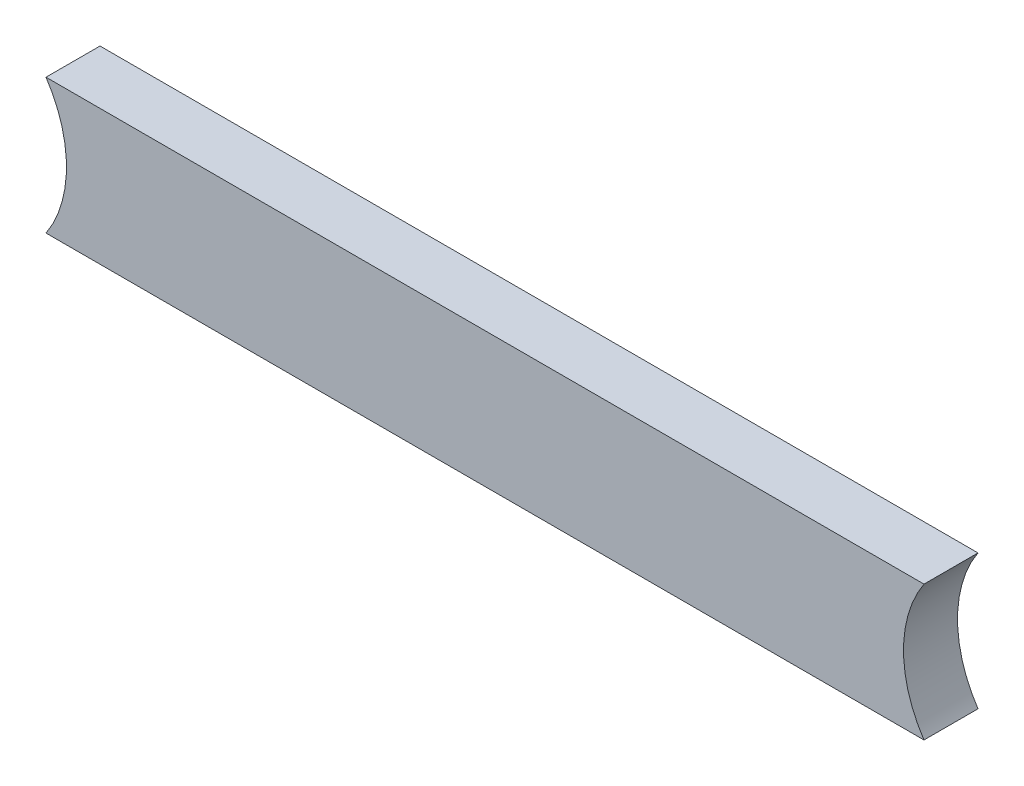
ISO-10303-21;
HEADER;
FILE_DESCRIPTION(('STEP AP214'),'2;1');
FILE_NAME('part.step','',(''),(''),'','','');
FILE_SCHEMA(('AUTOMOTIVE_DESIGN { 1 0 10303 214 1 1 1 1 }'));
ENDSEC;
DATA;
#1=APPLICATION_CONTEXT('core data for automotive mechanical design processes');
#2=APPLICATION_PROTOCOL_DEFINITION('international standard','automotive_design',2000,#1);
#3=PRODUCT_CONTEXT('',#1,'mechanical');
#4=PRODUCT('Part','Part','',(#3));
#5=PRODUCT_RELATED_PRODUCT_CATEGORY('part','',(#4));
#6=PRODUCT_DEFINITION_FORMATION('','',#4);
#7=PRODUCT_DEFINITION_CONTEXT('part definition',#1,'design');
#8=PRODUCT_DEFINITION('design','',#6,#7);
#9=PRODUCT_DEFINITION_SHAPE('','',#8);
#10=(LENGTH_UNIT() NAMED_UNIT(*) SI_UNIT(.MILLI.,.METRE.));
#11=(NAMED_UNIT(*) PLANE_ANGLE_UNIT() SI_UNIT($,.RADIAN.));
#12=(NAMED_UNIT(*) SI_UNIT($,.STERADIAN.) SOLID_ANGLE_UNIT());
#13=UNCERTAINTY_MEASURE_WITH_UNIT(LENGTH_MEASURE(1.E-05),#10,'distance_accuracy_value','');
#14=(GEOMETRIC_REPRESENTATION_CONTEXT(3) GLOBAL_UNCERTAINTY_ASSIGNED_CONTEXT((#13)) GLOBAL_UNIT_ASSIGNED_CONTEXT((#10,
#11,#12)) REPRESENTATION_CONTEXT('',''));
#15=CARTESIAN_POINT('',(0.,0.,0.));
#16=DIRECTION('',(0.,0.,1.));
#17=DIRECTION('',(1.,0.,0.));
#18=AXIS2_PLACEMENT_3D('',#15,#16,#17);
#19=CARTESIAN_POINT('',(-100.,0.,10.));
#20=DIRECTION('',(0.,0.,-1.));
#21=DIRECTION('',(-1.,0.,0.));
#22=AXIS2_PLACEMENT_3D('',#19,#20,#21);
#23=CYLINDRICAL_SURFACE('',#22,22.5);
#24=CARTESIAN_POINT('',(-100.,0.,0.));
#25=DIRECTION('',(0.,0.,-1.));
#26=DIRECTION('',(-1.,0.,0.));
#27=AXIS2_PLACEMENT_3D('',#24,#25,#26);
#28=CIRCLE('',#27,22.5);
#29=CARTESIAN_POINT('',(-81.2917130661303,12.5,0.));
#30=VERTEX_POINT('',#29);
#31=CARTESIAN_POINT('',(-81.2917130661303,-12.5,0.));
#32=VERTEX_POINT('',#31);
#33=EDGE_CURVE('E93',#30,#32,#28,.T.);
#34=ORIENTED_EDGE('',*,*,#33,.T.);
#35=DIRECTION('',(0.,0.,-1.));
#36=VECTOR('',#35,1.);
#37=CARTESIAN_POINT('',(-81.2917130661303,-12.5,10.));
#38=LINE('',#37,#36);
#39=CARTESIAN_POINT('',(-81.2917130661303,-12.5,10.));
#40=VERTEX_POINT('',#39);
#41=EDGE_CURVE('E11',#40,#32,#38,.T.);
#42=ORIENTED_EDGE('',*,*,#41,.F.);
#43=CARTESIAN_POINT('',(-100.,0.,10.));
#44=DIRECTION('',(0.,0.,-1.));
#45=DIRECTION('',(-1.,0.,0.));
#46=AXIS2_PLACEMENT_3D('',#43,#44,#45);
#47=CIRCLE('',#46,22.5);
#48=CARTESIAN_POINT('',(-81.2917130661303,12.5,10.));
#49=VERTEX_POINT('',#48);
#50=EDGE_CURVE('E81',#49,#40,#47,.T.);
#51=ORIENTED_EDGE('',*,*,#50,.F.);
#52=DIRECTION('',(0.,0.,-1.));
#53=VECTOR('',#52,1.);
#54=CARTESIAN_POINT('',(-81.2917130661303,12.5,10.));
#55=LINE('',#54,#53);
#56=EDGE_CURVE('E89',#49,#30,#55,.T.);
#57=ORIENTED_EDGE('',*,*,#56,.T.);
#58=EDGE_LOOP('',(#34,#42,#51,#57));
#59=FACE_BOUND('',#58,.T.);
#60=ADVANCED_FACE('F30',(#59),#23,.F.);
#61=CARTESIAN_POINT('',(-81.2917130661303,-12.5,10.));
#62=DIRECTION('',(0.,1.,0.));
#63=DIRECTION('',(-1.,0.,0.));
#64=AXIS2_PLACEMENT_3D('',#61,#62,#63);
#65=PLANE('',#64);
#66=DIRECTION('',(1.,0.,0.));
#67=VECTOR('',#66,1.);
#68=CARTESIAN_POINT('',(-81.2917130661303,-12.5,0.));
#69=LINE('',#68,#67);
#70=CARTESIAN_POINT('',(81.2917130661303,-12.5,0.));
#71=VERTEX_POINT('',#70);
#72=EDGE_CURVE('E85',#32,#71,#69,.T.);
#73=ORIENTED_EDGE('',*,*,#72,.T.);
#74=DIRECTION('',(0.,0.,-1.));
#75=VECTOR('',#74,1.);
#76=CARTESIAN_POINT('',(81.2917130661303,-12.5,10.));
#77=LINE('',#76,#75);
#78=CARTESIAN_POINT('',(81.2917130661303,-12.5,10.));
#79=VERTEX_POINT('',#78);
#80=EDGE_CURVE('E38',#79,#71,#77,.T.);
#81=ORIENTED_EDGE('',*,*,#80,.F.);
#82=DIRECTION('',(1.,0.,0.));
#83=VECTOR('',#82,1.);
#84=CARTESIAN_POINT('',(-81.2917130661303,-12.5,10.));
#85=LINE('',#84,#83);
#86=EDGE_CURVE('E76',#40,#79,#85,.T.);
#87=ORIENTED_EDGE('',*,*,#86,.F.);
#88=ORIENTED_EDGE('',*,*,#41,.T.);
#89=EDGE_LOOP('',(#73,#81,#87,#88));
#90=FACE_BOUND('',#89,.T.);
#91=ADVANCED_FACE('F84',(#90),#65,.F.);
#92=CARTESIAN_POINT('',(100.,0.,10.));
#93=DIRECTION('',(0.,0.,-1.));
#94=DIRECTION('',(-1.,0.,0.));
#95=AXIS2_PLACEMENT_3D('',#92,#93,#94);
#96=CYLINDRICAL_SURFACE('',#95,22.5);
#97=CARTESIAN_POINT('',(100.,0.,0.));
#98=DIRECTION('',(0.,0.,-1.));
#99=DIRECTION('',(1.,0.,0.));
#100=AXIS2_PLACEMENT_3D('',#97,#98,#99);
#101=CIRCLE('',#100,22.5);
#102=CARTESIAN_POINT('',(81.2917130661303,12.5,0.));
#103=VERTEX_POINT('',#102);
#104=EDGE_CURVE('E63',#71,#103,#101,.T.);
#105=ORIENTED_EDGE('',*,*,#104,.T.);
#106=DIRECTION('',(0.,0.,-1.));
#107=VECTOR('',#106,1.);
#108=CARTESIAN_POINT('',(81.2917130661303,12.5,10.));
#109=LINE('',#108,#107);
#110=CARTESIAN_POINT('',(81.2917130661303,12.5,10.));
#111=VERTEX_POINT('',#110);
#112=EDGE_CURVE('E86',#111,#103,#109,.T.);
#113=ORIENTED_EDGE('',*,*,#112,.F.);
#114=CARTESIAN_POINT('',(100.,0.,10.));
#115=DIRECTION('',(0.,0.,-1.));
#116=DIRECTION('',(1.,0.,0.));
#117=AXIS2_PLACEMENT_3D('',#114,#115,#116);
#118=CIRCLE('',#117,22.5);
#119=EDGE_CURVE('E79',#79,#111,#118,.T.);
#120=ORIENTED_EDGE('',*,*,#119,.F.);
#121=ORIENTED_EDGE('',*,*,#80,.T.);
#122=EDGE_LOOP('',(#105,#113,#120,#121));
#123=FACE_BOUND('',#122,.T.);
#124=ADVANCED_FACE('F87',(#123),#96,.F.);
#125=CARTESIAN_POINT('',(-81.2917130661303,12.5,10.));
#126=DIRECTION('',(0.,-1.,0.));
#127=DIRECTION('',(1.,0.,0.));
#128=AXIS2_PLACEMENT_3D('',#125,#126,#127);
#129=PLANE('',#128);
#130=DIRECTION('',(-1.,0.,0.));
#131=VECTOR('',#130,1.);
#132=CARTESIAN_POINT('',(-81.2917130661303,12.5,0.));
#133=LINE('',#132,#131);
#134=EDGE_CURVE('E69',#103,#30,#133,.T.);
#135=ORIENTED_EDGE('',*,*,#134,.T.);
#136=ORIENTED_EDGE('',*,*,#56,.F.);
#137=DIRECTION('',(-1.,0.,0.));
#138=VECTOR('',#137,1.);
#139=CARTESIAN_POINT('',(-81.2917130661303,12.5,10.));
#140=LINE('',#139,#138);
#141=EDGE_CURVE('E46',#111,#49,#140,.T.);
#142=ORIENTED_EDGE('',*,*,#141,.F.);
#143=ORIENTED_EDGE('',*,*,#112,.T.);
#144=EDGE_LOOP('',(#135,#136,#142,#143));
#145=FACE_BOUND('',#144,.T.);
#146=ADVANCED_FACE('F100',(#145),#129,.F.);
#147=CARTESIAN_POINT('',(-100.,0.,10.));
#148=DIRECTION('',(0.,0.,-1.));
#149=DIRECTION('',(-1.,0.,0.));
#150=AXIS2_PLACEMENT_3D('',#147,#148,#149);
#151=PLANE('',#150);
#152=ORIENTED_EDGE('',*,*,#50,.T.);
#153=ORIENTED_EDGE('',*,*,#86,.T.);
#154=ORIENTED_EDGE('',*,*,#119,.T.);
#155=ORIENTED_EDGE('',*,*,#141,.T.);
#156=EDGE_LOOP('',(#152,#153,#154,#155));
#157=FACE_BOUND('',#156,.T.);
#158=ADVANCED_FACE('F77',(#157),#151,.F.);
#159=CARTESIAN_POINT('',(-100.,0.,0.));
#160=DIRECTION('',(0.,0.,-1.));
#161=DIRECTION('',(-1.,0.,0.));
#162=AXIS2_PLACEMENT_3D('',#159,#160,#161);
#163=PLANE('',#162);
#164=ORIENTED_EDGE('',*,*,#33,.F.);
#165=ORIENTED_EDGE('',*,*,#134,.F.);
#166=ORIENTED_EDGE('',*,*,#104,.F.);
#167=ORIENTED_EDGE('',*,*,#72,.F.);
#168=EDGE_LOOP('',(#164,#165,#166,#167));
#169=FACE_BOUND('',#168,.T.);
#170=ADVANCED_FACE('F103',(#169),#163,.T.);
#171=CLOSED_SHELL('',(#60,#91,#124,#146,#158,#170));
#172=MANIFOLD_SOLID_BREP('B2',#171);
#173=ADVANCED_BREP_SHAPE_REPRESENTATION('',(#18,#172),#14);
#174=SHAPE_DEFINITION_REPRESENTATION(#9,#173);
ENDSEC;
END-ISO-10303-21;
